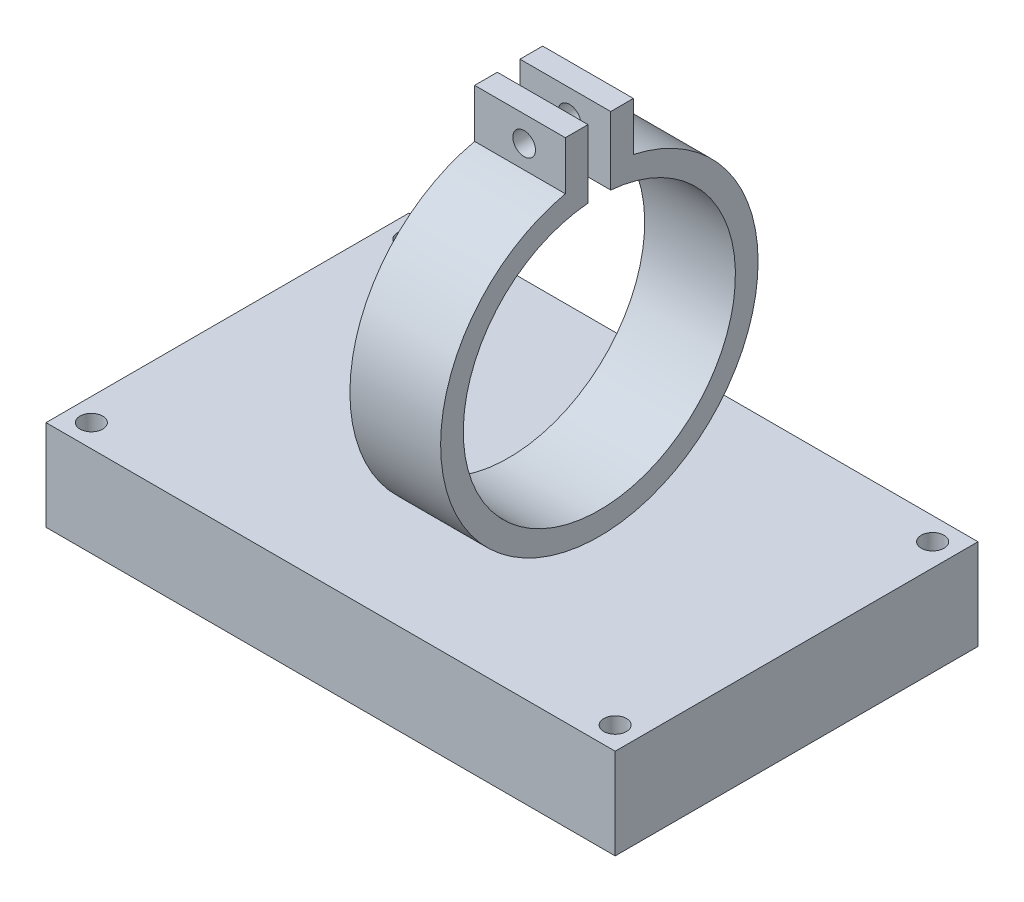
from build123d import *

# Parameters (mm, degrees)
SKETCH1_W           = 125.5
SKETCH1_H           = 80
SKETCH1_R           = 2.5
BOSS_EXTRUDE1_DEPTH = 20
BOSS_EXTRUDE2_DEPTH = 20
SKETCH3_W           = 5
SKETCH3_H           = 15
BOSS_EXTRUDE3_DEPTH = 20
SKETCH4_R           = 2.5
CUT_EXTRUDE1_DEPTH  = 100


with BuildPart() as part:
    # Sketch1 → Boss-Extrude1 (new body)
    with BuildSketch(Plane(origin=(0, 0, 0), x_dir=(1, 0, 0), z_dir=(0, 1, 0))):
        Rectangle(SKETCH1_W, SKETCH1_H)
        with Locations(Location((-57.75, 35, 0), (0, 0, 270))):
            Circle(SKETCH1_R, mode=Mode.SUBTRACT)
        with Locations(Location((-57.75, -35, 0), (0, 0, 270))):
            Circle(SKETCH1_R, mode=Mode.SUBTRACT)
        with Locations(Location((57.75, 35, 0), (0, 0, 270))):
            Circle(SKETCH1_R, mode=Mode.SUBTRACT)
        with Locations(Location((57.75, -35, 0), (0, 0, 270))):
            Circle(SKETCH1_R, mode=Mode.SUBTRACT)
    extrude(amount=BOSS_EXTRUDE1_DEPTH)


with BuildPart() as body_2:
    # Sketch2 → Boss-Extrude2 (new body)
    with BuildSketch(Plane(origin=(0, 0, 0), x_dir=(0, 0, -1), z_dir=(1, 0, 0))):
        with BuildLine():
            Line((-3.237992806, 84.895651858), (-3.237992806, 89.910600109))
            ThreePointArc((-3.237992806, 89.910600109), (-0.737992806, 20), (1.762007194, 89.910600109))
            Line((1.762007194, 89.910600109), (1.762007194, 84.895651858))
            ThreePointArc((1.762007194, 84.895651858), (-0.737992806, 25), (-3.237992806, 84.895651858))
        make_face()
    extrude(amount=BOSS_EXTRUDE2_DEPTH)

    # Sketch3 → Boss-Extrude3 (add)
    with BuildSketch(Plane(origin=(20, 0, 0), x_dir=(0, 0, -1), z_dir=(1, 0, 0))):
        with Locations((4.262007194, 92.395651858)):
            Rectangle(SKETCH3_W, SKETCH3_H)
        with Locations((-5.737992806, 92.395651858)):
            Rectangle(SKETCH3_W, SKETCH3_H)
    extrude(amount=-BOSS_EXTRUDE3_DEPTH)

    # Sketch4 → Cut-Extrude1 (cut)
    with BuildSketch(Plane.XY.offset(8.237992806)):
        with Locations((10.919770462, 94.232950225)):
            Circle(SKETCH4_R)
    extrude(amount=-CUT_EXTRUDE1_DEPTH, mode=Mode.SUBTRACT)


solid = Compound([part.part, body_2.part])
